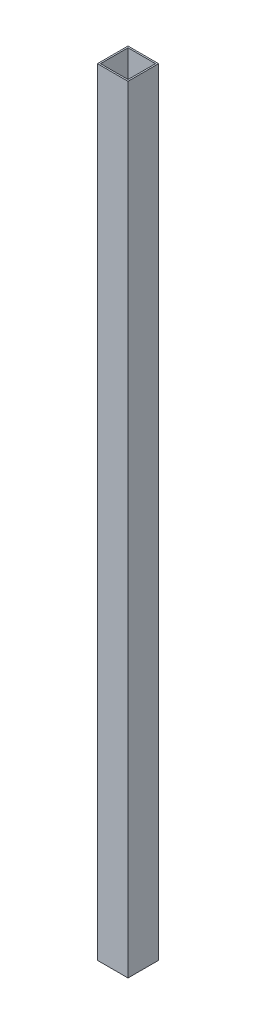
ISO-10303-21;
HEADER;
FILE_DESCRIPTION(('STEP AP214'),'2;1');
FILE_NAME('part.step','',(''),(''),'','','');
FILE_SCHEMA(('AUTOMOTIVE_DESIGN { 1 0 10303 214 1 1 1 1 }'));
ENDSEC;
DATA;
#1=APPLICATION_CONTEXT('core data for automotive mechanical design processes');
#2=APPLICATION_PROTOCOL_DEFINITION('international standard','automotive_design',2000,#1);
#3=PRODUCT_CONTEXT('',#1,'mechanical');
#4=PRODUCT('Part','Part','',(#3));
#5=PRODUCT_RELATED_PRODUCT_CATEGORY('part','',(#4));
#6=PRODUCT_DEFINITION_FORMATION('','',#4);
#7=PRODUCT_DEFINITION_CONTEXT('part definition',#1,'design');
#8=PRODUCT_DEFINITION('design','',#6,#7);
#9=PRODUCT_DEFINITION_SHAPE('','',#8);
#10=(LENGTH_UNIT() NAMED_UNIT(*) SI_UNIT(.MILLI.,.METRE.));
#11=(NAMED_UNIT(*) PLANE_ANGLE_UNIT() SI_UNIT($,.RADIAN.));
#12=(NAMED_UNIT(*) SI_UNIT($,.STERADIAN.) SOLID_ANGLE_UNIT());
#13=UNCERTAINTY_MEASURE_WITH_UNIT(LENGTH_MEASURE(1.E-05),#10,'distance_accuracy_value','');
#14=(GEOMETRIC_REPRESENTATION_CONTEXT(3) GLOBAL_UNCERTAINTY_ASSIGNED_CONTEXT((#13)) GLOBAL_UNIT_ASSIGNED_CONTEXT((#10,
#11,#12)) REPRESENTATION_CONTEXT('',''));
#15=CARTESIAN_POINT('',(0.,0.,0.));
#16=DIRECTION('',(0.,0.,1.));
#17=DIRECTION('',(1.,0.,0.));
#18=AXIS2_PLACEMENT_3D('',#15,#16,#17);
#19=CARTESIAN_POINT('',(25.,1270.,-25.));
#20=DIRECTION('',(-1.,0.,0.));
#21=DIRECTION('',(0.,0.,1.));
#22=AXIS2_PLACEMENT_3D('',#19,#20,#21);
#23=PLANE('',#22);
#24=DIRECTION('',(0.,0.,-1.));
#25=VECTOR('',#24,1.);
#26=CARTESIAN_POINT('',(25.,0.,-25.));
#27=LINE('',#26,#25);
#28=CARTESIAN_POINT('',(25.,0.,25.));
#29=VERTEX_POINT('',#28);
#30=CARTESIAN_POINT('',(25.,0.,-25.));
#31=VERTEX_POINT('',#30);
#32=EDGE_CURVE('E163',#29,#31,#27,.T.);
#33=ORIENTED_EDGE('',*,*,#32,.T.);
#34=DIRECTION('',(0.,-1.,0.));
#35=VECTOR('',#34,1.);
#36=CARTESIAN_POINT('',(25.,1270.,-25.));
#37=LINE('',#36,#35);
#38=CARTESIAN_POINT('',(25.,1270.,-25.));
#39=VERTEX_POINT('',#38);
#40=EDGE_CURVE('E11',#39,#31,#37,.T.);
#41=ORIENTED_EDGE('',*,*,#40,.F.);
#42=DIRECTION('',(0.,0.,-1.));
#43=VECTOR('',#42,1.);
#44=CARTESIAN_POINT('',(25.,1270.,-25.));
#45=LINE('',#44,#43);
#46=CARTESIAN_POINT('',(25.,1270.,25.));
#47=VERTEX_POINT('',#46);
#48=EDGE_CURVE('E148',#47,#39,#45,.T.);
#49=ORIENTED_EDGE('',*,*,#48,.F.);
#50=DIRECTION('',(0.,-1.,0.));
#51=VECTOR('',#50,1.);
#52=CARTESIAN_POINT('',(25.,1270.,25.));
#53=LINE('',#52,#51);
#54=EDGE_CURVE('E162',#47,#29,#53,.T.);
#55=ORIENTED_EDGE('',*,*,#54,.T.);
#56=EDGE_LOOP('',(#33,#41,#49,#55));
#57=FACE_BOUND('',#56,.T.);
#58=ADVANCED_FACE('F41',(#57),#23,.F.);
#59=CARTESIAN_POINT('',(-25.,1270.,-25.));
#60=DIRECTION('',(0.,0.,1.));
#61=DIRECTION('',(1.,0.,0.));
#62=AXIS2_PLACEMENT_3D('',#59,#60,#61);
#63=PLANE('',#62);
#64=DIRECTION('',(-1.,0.,0.));
#65=VECTOR('',#64,1.);
#66=CARTESIAN_POINT('',(-25.,0.,-25.));
#67=LINE('',#66,#65);
#68=CARTESIAN_POINT('',(-25.,0.,-25.));
#69=VERTEX_POINT('',#68);
#70=EDGE_CURVE('E167',#31,#69,#67,.T.);
#71=ORIENTED_EDGE('',*,*,#70,.T.);
#72=DIRECTION('',(0.,-1.,0.));
#73=VECTOR('',#72,1.);
#74=CARTESIAN_POINT('',(-25.,1270.,-25.));
#75=LINE('',#74,#73);
#76=CARTESIAN_POINT('',(-25.,1270.,-25.));
#77=VERTEX_POINT('',#76);
#78=EDGE_CURVE('E49',#77,#69,#75,.T.);
#79=ORIENTED_EDGE('',*,*,#78,.F.);
#80=DIRECTION('',(-1.,0.,0.));
#81=VECTOR('',#80,1.);
#82=CARTESIAN_POINT('',(-25.,1270.,-25.));
#83=LINE('',#82,#81);
#84=EDGE_CURVE('E152',#39,#77,#83,.T.);
#85=ORIENTED_EDGE('',*,*,#84,.F.);
#86=ORIENTED_EDGE('',*,*,#40,.T.);
#87=EDGE_LOOP('',(#71,#79,#85,#86));
#88=FACE_BOUND('',#87,.T.);
#89=ADVANCED_FACE('F201',(#88),#63,.F.);
#90=CARTESIAN_POINT('',(-25.,1270.,-25.));
#91=DIRECTION('',(1.,0.,0.));
#92=DIRECTION('',(0.,0.,-1.));
#93=AXIS2_PLACEMENT_3D('',#90,#91,#92);
#94=PLANE('',#93);
#95=DIRECTION('',(0.,0.,1.));
#96=VECTOR('',#95,1.);
#97=CARTESIAN_POINT('',(-25.,0.,-25.));
#98=LINE('',#97,#96);
#99=CARTESIAN_POINT('',(-25.,0.,25.));
#100=VERTEX_POINT('',#99);
#101=EDGE_CURVE('E170',#69,#100,#98,.T.);
#102=ORIENTED_EDGE('',*,*,#101,.T.);
#103=DIRECTION('',(0.,-1.,0.));
#104=VECTOR('',#103,1.);
#105=CARTESIAN_POINT('',(-25.,1270.,25.));
#106=LINE('',#105,#104);
#107=CARTESIAN_POINT('',(-25.,1270.,25.));
#108=VERTEX_POINT('',#107);
#109=EDGE_CURVE('E178',#108,#100,#106,.T.);
#110=ORIENTED_EDGE('',*,*,#109,.F.);
#111=DIRECTION('',(0.,0.,1.));
#112=VECTOR('',#111,1.);
#113=CARTESIAN_POINT('',(-25.,1270.,-25.));
#114=LINE('',#113,#112);
#115=EDGE_CURVE('E156',#77,#108,#114,.T.);
#116=ORIENTED_EDGE('',*,*,#115,.F.);
#117=ORIENTED_EDGE('',*,*,#78,.T.);
#118=EDGE_LOOP('',(#102,#110,#116,#117));
#119=FACE_BOUND('',#118,.T.);
#120=ADVANCED_FACE('F187',(#119),#94,.F.);
#121=CARTESIAN_POINT('',(-25.,1270.,25.));
#122=DIRECTION('',(0.,0.,-1.));
#123=DIRECTION('',(-1.,0.,0.));
#124=AXIS2_PLACEMENT_3D('',#121,#122,#123);
#125=PLANE('',#124);
#126=DIRECTION('',(1.,0.,0.));
#127=VECTOR('',#126,1.);
#128=CARTESIAN_POINT('',(-25.,0.,25.));
#129=LINE('',#128,#127);
#130=EDGE_CURVE('E153',#100,#29,#129,.T.);
#131=ORIENTED_EDGE('',*,*,#130,.T.);
#132=ORIENTED_EDGE('',*,*,#54,.F.);
#133=DIRECTION('',(1.,0.,0.));
#134=VECTOR('',#133,1.);
#135=CARTESIAN_POINT('',(-25.,1270.,25.));
#136=LINE('',#135,#134);
#137=EDGE_CURVE('E159',#108,#47,#136,.T.);
#138=ORIENTED_EDGE('',*,*,#137,.F.);
#139=ORIENTED_EDGE('',*,*,#109,.T.);
#140=EDGE_LOOP('',(#131,#132,#138,#139));
#141=FACE_BOUND('',#140,.T.);
#142=ADVANCED_FACE('F194',(#141),#125,.F.);
#143=CARTESIAN_POINT('',(0.,1270.,0.));
#144=DIRECTION('',(0.,1.,0.));
#145=DIRECTION('',(0.,0.,1.));
#146=AXIS2_PLACEMENT_3D('',#143,#144,#145);
#147=PLANE('',#146);
#148=DIRECTION('',(0.,0.,-1.));
#149=VECTOR('',#148,1.);
#150=CARTESIAN_POINT('',(22.5,1270.,-25.));
#151=LINE('',#150,#149);
#152=CARTESIAN_POINT('',(22.5,1270.,22.5));
#153=VERTEX_POINT('',#152);
#154=CARTESIAN_POINT('',(22.5,1270.,-22.5));
#155=VERTEX_POINT('',#154);
#156=EDGE_CURVE('E130',#153,#155,#151,.T.);
#157=ORIENTED_EDGE('',*,*,#156,.F.);
#158=DIRECTION('',(1.,0.,0.));
#159=VECTOR('',#158,1.);
#160=CARTESIAN_POINT('',(-25.,1270.,22.5));
#161=LINE('',#160,#159);
#162=CARTESIAN_POINT('',(-22.5,1270.,22.5));
#163=VERTEX_POINT('',#162);
#164=EDGE_CURVE('E111',#163,#153,#161,.T.);
#165=ORIENTED_EDGE('',*,*,#164,.F.);
#166=DIRECTION('',(0.,0.,1.));
#167=VECTOR('',#166,1.);
#168=CARTESIAN_POINT('',(-22.5,1270.,-25.));
#169=LINE('',#168,#167);
#170=CARTESIAN_POINT('',(-22.5,1270.,-22.5));
#171=VERTEX_POINT('',#170);
#172=EDGE_CURVE('E143',#171,#163,#169,.T.);
#173=ORIENTED_EDGE('',*,*,#172,.F.);
#174=DIRECTION('',(-1.,0.,0.));
#175=VECTOR('',#174,1.);
#176=CARTESIAN_POINT('',(-25.,1270.,-22.5));
#177=LINE('',#176,#175);
#178=EDGE_CURVE('E134',#155,#171,#177,.T.);
#179=ORIENTED_EDGE('',*,*,#178,.F.);
#180=EDGE_LOOP('',(#157,#165,#173,#179));
#181=FACE_BOUND('',#180,.T.);
#182=ORIENTED_EDGE('',*,*,#48,.T.);
#183=ORIENTED_EDGE('',*,*,#84,.T.);
#184=ORIENTED_EDGE('',*,*,#115,.T.);
#185=ORIENTED_EDGE('',*,*,#137,.T.);
#186=EDGE_LOOP('',(#182,#183,#184,#185));
#187=FACE_BOUND('',#186,.T.);
#188=ADVANCED_FACE('F200',(#181,#187),#147,.T.);
#189=CARTESIAN_POINT('',(0.,0.,0.));
#190=DIRECTION('',(0.,1.,0.));
#191=DIRECTION('',(0.,0.,1.));
#192=AXIS2_PLACEMENT_3D('',#189,#190,#191);
#193=PLANE('',#192);
#194=DIRECTION('',(1.,0.,0.));
#195=VECTOR('',#194,1.);
#196=CARTESIAN_POINT('',(-25.,0.,22.5));
#197=LINE('',#196,#195);
#198=CARTESIAN_POINT('',(-22.5,0.,22.5));
#199=VERTEX_POINT('',#198);
#200=CARTESIAN_POINT('',(22.5,0.,22.5));
#201=VERTEX_POINT('',#200);
#202=EDGE_CURVE('E109',#199,#201,#197,.T.);
#203=ORIENTED_EDGE('',*,*,#202,.T.);
#204=DIRECTION('',(0.,0.,-1.));
#205=VECTOR('',#204,1.);
#206=CARTESIAN_POINT('',(22.5,0.,-25.));
#207=LINE('',#206,#205);
#208=CARTESIAN_POINT('',(22.5,0.,-22.5));
#209=VERTEX_POINT('',#208);
#210=EDGE_CURVE('E118',#201,#209,#207,.T.);
#211=ORIENTED_EDGE('',*,*,#210,.T.);
#212=DIRECTION('',(-1.,0.,0.));
#213=VECTOR('',#212,1.);
#214=CARTESIAN_POINT('',(-25.,0.,-22.5));
#215=LINE('',#214,#213);
#216=CARTESIAN_POINT('',(-22.5,0.,-22.5));
#217=VERTEX_POINT('',#216);
#218=EDGE_CURVE('E125',#209,#217,#215,.T.);
#219=ORIENTED_EDGE('',*,*,#218,.T.);
#220=DIRECTION('',(0.,0.,1.));
#221=VECTOR('',#220,1.);
#222=CARTESIAN_POINT('',(-22.5,0.,-25.));
#223=LINE('',#222,#221);
#224=EDGE_CURVE('E63',#217,#199,#223,.T.);
#225=ORIENTED_EDGE('',*,*,#224,.T.);
#226=EDGE_LOOP('',(#203,#211,#219,#225));
#227=FACE_BOUND('',#226,.T.);
#228=ORIENTED_EDGE('',*,*,#32,.F.);
#229=ORIENTED_EDGE('',*,*,#130,.F.);
#230=ORIENTED_EDGE('',*,*,#101,.F.);
#231=ORIENTED_EDGE('',*,*,#70,.F.);
#232=EDGE_LOOP('',(#228,#229,#230,#231));
#233=FACE_BOUND('',#232,.T.);
#234=ADVANCED_FACE('F127',(#227,#233),#193,.F.);
#235=CARTESIAN_POINT('',(22.5,1270.,-25.));
#236=DIRECTION('',(-1.,0.,0.));
#237=DIRECTION('',(0.,0.,1.));
#238=AXIS2_PLACEMENT_3D('',#235,#236,#237);
#239=PLANE('',#238);
#240=ORIENTED_EDGE('',*,*,#210,.F.);
#241=DIRECTION('',(0.,-1.,0.));
#242=VECTOR('',#241,1.);
#243=CARTESIAN_POINT('',(22.5,1270.,22.5));
#244=LINE('',#243,#242);
#245=EDGE_CURVE('E105',#153,#201,#244,.T.);
#246=ORIENTED_EDGE('',*,*,#245,.F.);
#247=ORIENTED_EDGE('',*,*,#156,.T.);
#248=DIRECTION('',(0.,-1.,0.));
#249=VECTOR('',#248,1.);
#250=CARTESIAN_POINT('',(22.5,1270.,-22.5));
#251=LINE('',#250,#249);
#252=EDGE_CURVE('E121',#155,#209,#251,.T.);
#253=ORIENTED_EDGE('',*,*,#252,.T.);
#254=EDGE_LOOP('',(#240,#246,#247,#253));
#255=FACE_BOUND('',#254,.T.);
#256=ADVANCED_FACE('F119',(#255),#239,.T.);
#257=CARTESIAN_POINT('',(-25.,1270.,-22.5));
#258=DIRECTION('',(0.,0.,1.));
#259=DIRECTION('',(1.,0.,0.));
#260=AXIS2_PLACEMENT_3D('',#257,#258,#259);
#261=PLANE('',#260);
#262=ORIENTED_EDGE('',*,*,#218,.F.);
#263=ORIENTED_EDGE('',*,*,#252,.F.);
#264=ORIENTED_EDGE('',*,*,#178,.T.);
#265=DIRECTION('',(0.,-1.,0.));
#266=VECTOR('',#265,1.);
#267=CARTESIAN_POINT('',(-22.5,1270.,-22.5));
#268=LINE('',#267,#266);
#269=EDGE_CURVE('E285',#171,#217,#268,.T.);
#270=ORIENTED_EDGE('',*,*,#269,.T.);
#271=EDGE_LOOP('',(#262,#263,#264,#270));
#272=FACE_BOUND('',#271,.T.);
#273=ADVANCED_FACE('F221',(#272),#261,.T.);
#274=CARTESIAN_POINT('',(-22.5,1270.,-25.));
#275=DIRECTION('',(1.,0.,0.));
#276=DIRECTION('',(0.,0.,-1.));
#277=AXIS2_PLACEMENT_3D('',#274,#275,#276);
#278=PLANE('',#277);
#279=ORIENTED_EDGE('',*,*,#224,.F.);
#280=ORIENTED_EDGE('',*,*,#269,.F.);
#281=ORIENTED_EDGE('',*,*,#172,.T.);
#282=DIRECTION('',(0.,-1.,0.));
#283=VECTOR('',#282,1.);
#284=CARTESIAN_POINT('',(-22.5,1270.,22.5));
#285=LINE('',#284,#283);
#286=EDGE_CURVE('E56',#163,#199,#285,.T.);
#287=ORIENTED_EDGE('',*,*,#286,.T.);
#288=EDGE_LOOP('',(#279,#280,#281,#287));
#289=FACE_BOUND('',#288,.T.);
#290=ADVANCED_FACE('F218',(#289),#278,.T.);
#291=CARTESIAN_POINT('',(-25.,1270.,22.5));
#292=DIRECTION('',(0.,0.,-1.));
#293=DIRECTION('',(-1.,0.,0.));
#294=AXIS2_PLACEMENT_3D('',#291,#292,#293);
#295=PLANE('',#294);
#296=ORIENTED_EDGE('',*,*,#202,.F.);
#297=ORIENTED_EDGE('',*,*,#286,.F.);
#298=ORIENTED_EDGE('',*,*,#164,.T.);
#299=ORIENTED_EDGE('',*,*,#245,.T.);
#300=EDGE_LOOP('',(#296,#297,#298,#299));
#301=FACE_BOUND('',#300,.T.);
#302=ADVANCED_FACE('F107',(#301),#295,.T.);
#303=CLOSED_SHELL('',(#58,#89,#120,#142,#188,#234,#256,#273,#290,#302));
#304=MANIFOLD_SOLID_BREP('B2',#303);
#305=ADVANCED_BREP_SHAPE_REPRESENTATION('',(#18,#304),#14);
#306=SHAPE_DEFINITION_REPRESENTATION(#9,#305);
ENDSEC;
END-ISO-10303-21;
